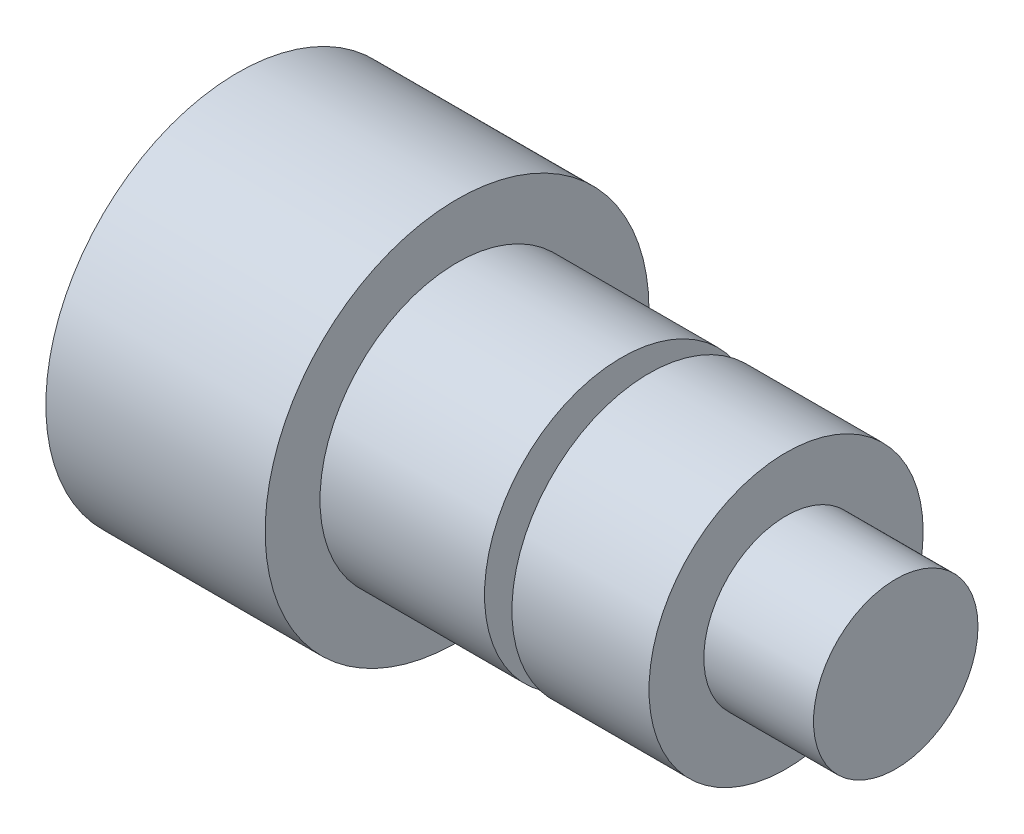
ISO-10303-21;
HEADER;
FILE_DESCRIPTION(('STEP AP214'),'2;1');
FILE_NAME('part.step','',(''),(''),'','','');
FILE_SCHEMA(('AUTOMOTIVE_DESIGN { 1 0 10303 214 1 1 1 1 }'));
ENDSEC;
DATA;
#1=APPLICATION_CONTEXT('core data for automotive mechanical design processes');
#2=APPLICATION_PROTOCOL_DEFINITION('international standard','automotive_design',2000,#1);
#3=PRODUCT_CONTEXT('',#1,'mechanical');
#4=PRODUCT('Part','Part','',(#3));
#5=PRODUCT_RELATED_PRODUCT_CATEGORY('part','',(#4));
#6=PRODUCT_DEFINITION_FORMATION('','',#4);
#7=PRODUCT_DEFINITION_CONTEXT('part definition',#1,'design');
#8=PRODUCT_DEFINITION('design','',#6,#7);
#9=PRODUCT_DEFINITION_SHAPE('','',#8);
#10=(LENGTH_UNIT() NAMED_UNIT(*) SI_UNIT(.MILLI.,.METRE.));
#11=(NAMED_UNIT(*) PLANE_ANGLE_UNIT() SI_UNIT($,.RADIAN.));
#12=(NAMED_UNIT(*) SI_UNIT($,.STERADIAN.) SOLID_ANGLE_UNIT());
#13=UNCERTAINTY_MEASURE_WITH_UNIT(LENGTH_MEASURE(1.E-05),#10,'distance_accuracy_value','');
#14=(GEOMETRIC_REPRESENTATION_CONTEXT(3) GLOBAL_UNCERTAINTY_ASSIGNED_CONTEXT((#13)) GLOBAL_UNIT_ASSIGNED_CONTEXT((#10,
#11,#12)) REPRESENTATION_CONTEXT('',''));
#15=CARTESIAN_POINT('',(0.,0.,0.));
#16=DIRECTION('',(0.,0.,1.));
#17=DIRECTION('',(1.,0.,0.));
#18=AXIS2_PLACEMENT_3D('',#15,#16,#17);
#19=CARTESIAN_POINT('',(0.,0.,0.));
#20=DIRECTION('',(1.,0.,0.));
#21=DIRECTION('',(0.,0.,-1.));
#22=AXIS2_PLACEMENT_3D('',#19,#20,#21);
#23=PLANE('',#22);
#24=CARTESIAN_POINT('',(0.,0.,0.));
#25=DIRECTION('',(1.,0.,0.));
#26=DIRECTION('',(0.,0.,-1.));
#27=AXIS2_PLACEMENT_3D('',#24,#25,#26);
#28=CIRCLE('',#27,44.45);
#29=CARTESIAN_POINT('',(0.,0.,-44.45));
#30=VERTEX_POINT('',#29);
#31=EDGE_CURVE('E10',#30,#30,#28,.T.);
#32=ORIENTED_EDGE('',*,*,#31,.F.);
#33=EDGE_LOOP('',(#32));
#34=FACE_BOUND('',#33,.T.);
#35=ADVANCED_FACE('F30',(#34),#23,.F.);
#36=CARTESIAN_POINT('',(213.782929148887,0.,0.));
#37=DIRECTION('',(1.,0.,0.));
#38=DIRECTION('',(0.,0.,-1.));
#39=AXIS2_PLACEMENT_3D('',#36,#37,#38);
#40=CYLINDRICAL_SURFACE('',#39,44.45);
#41=CARTESIAN_POINT('',(50.8,0.,0.));
#42=DIRECTION('',(1.,0.,0.));
#43=DIRECTION('',(0.,0.,-1.));
#44=AXIS2_PLACEMENT_3D('',#41,#42,#43);
#45=CIRCLE('',#44,44.45);
#46=CARTESIAN_POINT('',(50.8,0.,-44.45));
#47=VERTEX_POINT('',#46);
#48=EDGE_CURVE('E36',#47,#47,#45,.T.);
#49=ORIENTED_EDGE('',*,*,#48,.F.);
#50=EDGE_LOOP('',(#49));
#51=FACE_BOUND('',#50,.T.);
#52=ORIENTED_EDGE('',*,*,#31,.T.);
#53=EDGE_LOOP('',(#52));
#54=FACE_BOUND('',#53,.T.);
#55=ADVANCED_FACE('F114',(#51,#54),#40,.T.);
#56=CARTESIAN_POINT('',(50.8,44.45,0.));
#57=DIRECTION('',(-1.,0.,0.));
#58=DIRECTION('',(0.,0.,1.));
#59=AXIS2_PLACEMENT_3D('',#56,#57,#58);
#60=PLANE('',#59);
#61=CARTESIAN_POINT('',(50.8,0.,0.));
#62=DIRECTION('',(1.,0.,0.));
#63=DIRECTION('',(0.,0.,-1.));
#64=AXIS2_PLACEMENT_3D('',#61,#62,#63);
#65=CIRCLE('',#64,31.75);
#66=CARTESIAN_POINT('',(50.8,0.,-31.75));
#67=VERTEX_POINT('',#66);
#68=EDGE_CURVE('E40',#67,#67,#65,.T.);
#69=ORIENTED_EDGE('',*,*,#68,.F.);
#70=EDGE_LOOP('',(#69));
#71=FACE_BOUND('',#70,.T.);
#72=ORIENTED_EDGE('',*,*,#48,.T.);
#73=EDGE_LOOP('',(#72));
#74=FACE_BOUND('',#73,.T.);
#75=ADVANCED_FACE('F109',(#71,#74),#60,.F.);
#76=CARTESIAN_POINT('',(213.782929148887,0.,0.));
#77=DIRECTION('',(1.,0.,0.));
#78=DIRECTION('',(0.,0.,-1.));
#79=AXIS2_PLACEMENT_3D('',#76,#77,#78);
#80=CYLINDRICAL_SURFACE('',#79,31.75);
#81=CARTESIAN_POINT('',(88.9,0.,0.));
#82=DIRECTION('',(1.,0.,0.));
#83=DIRECTION('',(0.,0.,-1.));
#84=AXIS2_PLACEMENT_3D('',#81,#82,#83);
#85=CIRCLE('',#84,31.75);
#86=CARTESIAN_POINT('',(88.9,0.,-31.75));
#87=VERTEX_POINT('',#86);
#88=EDGE_CURVE('E44',#87,#87,#85,.T.);
#89=ORIENTED_EDGE('',*,*,#88,.F.);
#90=EDGE_LOOP('',(#89));
#91=FACE_BOUND('',#90,.T.);
#92=ORIENTED_EDGE('',*,*,#68,.T.);
#93=EDGE_LOOP('',(#92));
#94=FACE_BOUND('',#93,.T.);
#95=ADVANCED_FACE('F103',(#91,#94),#80,.T.);
#96=CARTESIAN_POINT('',(88.9,31.75,0.));
#97=DIRECTION('',(-1.,0.,0.));
#98=DIRECTION('',(0.,0.,1.));
#99=AXIS2_PLACEMENT_3D('',#96,#97,#98);
#100=PLANE('',#99);
#101=CARTESIAN_POINT('',(88.9,0.,0.));
#102=DIRECTION('',(1.,0.,0.));
#103=DIRECTION('',(0.,0.,-1.));
#104=AXIS2_PLACEMENT_3D('',#101,#102,#103);
#105=CIRCLE('',#104,22.225);
#106=CARTESIAN_POINT('',(88.9,0.,-22.225));
#107=VERTEX_POINT('',#106);
#108=EDGE_CURVE('E49',#107,#107,#105,.T.);
#109=ORIENTED_EDGE('',*,*,#108,.F.);
#110=EDGE_LOOP('',(#109));
#111=FACE_BOUND('',#110,.T.);
#112=ORIENTED_EDGE('',*,*,#88,.T.);
#113=EDGE_LOOP('',(#112));
#114=FACE_BOUND('',#113,.T.);
#115=ADVANCED_FACE('F97',(#111,#114),#100,.F.);
#116=CARTESIAN_POINT('',(213.782929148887,0.,0.));
#117=DIRECTION('',(1.,0.,0.));
#118=DIRECTION('',(0.,0.,-1.));
#119=AXIS2_PLACEMENT_3D('',#116,#117,#118);
#120=CYLINDRICAL_SURFACE('',#119,22.225);
#121=CARTESIAN_POINT('',(95.25,0.,0.));
#122=DIRECTION('',(1.,0.,0.));
#123=DIRECTION('',(0.,0.,-1.));
#124=AXIS2_PLACEMENT_3D('',#121,#122,#123);
#125=CIRCLE('',#124,22.225);
#126=CARTESIAN_POINT('',(95.25,0.,-22.225));
#127=VERTEX_POINT('',#126);
#128=EDGE_CURVE('E52',#127,#127,#125,.T.);
#129=ORIENTED_EDGE('',*,*,#128,.F.);
#130=EDGE_LOOP('',(#129));
#131=FACE_BOUND('',#130,.T.);
#132=ORIENTED_EDGE('',*,*,#108,.T.);
#133=EDGE_LOOP('',(#132));
#134=FACE_BOUND('',#133,.T.);
#135=ADVANCED_FACE('F91',(#131,#134),#120,.T.);
#136=CARTESIAN_POINT('',(95.25,22.225,0.));
#137=DIRECTION('',(1.,0.,0.));
#138=DIRECTION('',(0.,0.,-1.));
#139=AXIS2_PLACEMENT_3D('',#136,#137,#138);
#140=PLANE('',#139);
#141=CARTESIAN_POINT('',(95.25,0.,0.));
#142=DIRECTION('',(1.,0.,0.));
#143=DIRECTION('',(0.,0.,-1.));
#144=AXIS2_PLACEMENT_3D('',#141,#142,#143);
#145=CIRCLE('',#144,31.75);
#146=CARTESIAN_POINT('',(95.25,0.,-31.75));
#147=VERTEX_POINT('',#146);
#148=EDGE_CURVE('E55',#147,#147,#145,.T.);
#149=ORIENTED_EDGE('',*,*,#148,.F.);
#150=EDGE_LOOP('',(#149));
#151=FACE_BOUND('',#150,.T.);
#152=ORIENTED_EDGE('',*,*,#128,.T.);
#153=EDGE_LOOP('',(#152));
#154=FACE_BOUND('',#153,.T.);
#155=ADVANCED_FACE('F85',(#151,#154),#140,.F.);
#156=CARTESIAN_POINT('',(213.782929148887,0.,0.));
#157=DIRECTION('',(1.,0.,0.));
#158=DIRECTION('',(0.,0.,-1.));
#159=AXIS2_PLACEMENT_3D('',#156,#157,#158);
#160=CYLINDRICAL_SURFACE('',#159,31.75);
#161=CARTESIAN_POINT('',(127.,0.,0.));
#162=DIRECTION('',(1.,0.,0.));
#163=DIRECTION('',(0.,0.,-1.));
#164=AXIS2_PLACEMENT_3D('',#161,#162,#163);
#165=CIRCLE('',#164,31.75);
#166=CARTESIAN_POINT('',(127.,0.,-31.75));
#167=VERTEX_POINT('',#166);
#168=EDGE_CURVE('E58',#167,#167,#165,.T.);
#169=ORIENTED_EDGE('',*,*,#168,.F.);
#170=EDGE_LOOP('',(#169));
#171=FACE_BOUND('',#170,.T.);
#172=ORIENTED_EDGE('',*,*,#148,.T.);
#173=EDGE_LOOP('',(#172));
#174=FACE_BOUND('',#173,.T.);
#175=ADVANCED_FACE('F79',(#171,#174),#160,.T.);
#176=CARTESIAN_POINT('',(127.,31.75,0.));
#177=DIRECTION('',(-1.,0.,0.));
#178=DIRECTION('',(0.,0.,1.));
#179=AXIS2_PLACEMENT_3D('',#176,#177,#178);
#180=PLANE('',#179);
#181=CARTESIAN_POINT('',(127.,0.,0.));
#182=DIRECTION('',(1.,0.,0.));
#183=DIRECTION('',(0.,0.,-1.));
#184=AXIS2_PLACEMENT_3D('',#181,#182,#183);
#185=CIRCLE('',#184,19.05);
#186=CARTESIAN_POINT('',(127.,0.,-19.05));
#187=VERTEX_POINT('',#186);
#188=EDGE_CURVE('E61',#187,#187,#185,.T.);
#189=ORIENTED_EDGE('',*,*,#188,.F.);
#190=EDGE_LOOP('',(#189));
#191=FACE_BOUND('',#190,.T.);
#192=ORIENTED_EDGE('',*,*,#168,.T.);
#193=EDGE_LOOP('',(#192));
#194=FACE_BOUND('',#193,.T.);
#195=ADVANCED_FACE('F73',(#191,#194),#180,.F.);
#196=CARTESIAN_POINT('',(213.782929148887,0.,0.));
#197=DIRECTION('',(1.,0.,0.));
#198=DIRECTION('',(0.,0.,-1.));
#199=AXIS2_PLACEMENT_3D('',#196,#197,#198);
#200=CYLINDRICAL_SURFACE('',#199,19.05);
#201=CARTESIAN_POINT('',(152.4,0.,0.));
#202=DIRECTION('',(1.,0.,0.));
#203=DIRECTION('',(0.,0.,-1.));
#204=AXIS2_PLACEMENT_3D('',#201,#202,#203);
#205=CIRCLE('',#204,19.05);
#206=CARTESIAN_POINT('',(152.4,0.,-19.05));
#207=VERTEX_POINT('',#206);
#208=EDGE_CURVE('E64',#207,#207,#205,.T.);
#209=ORIENTED_EDGE('',*,*,#208,.F.);
#210=EDGE_LOOP('',(#209));
#211=FACE_BOUND('',#210,.T.);
#212=ORIENTED_EDGE('',*,*,#188,.T.);
#213=EDGE_LOOP('',(#212));
#214=FACE_BOUND('',#213,.T.);
#215=ADVANCED_FACE('F70',(#211,#214),#200,.T.);
#216=CARTESIAN_POINT('',(152.4,19.05,0.));
#217=DIRECTION('',(-1.,0.,0.));
#218=DIRECTION('',(0.,0.,1.));
#219=AXIS2_PLACEMENT_3D('',#216,#217,#218);
#220=PLANE('',#219);
#221=ORIENTED_EDGE('',*,*,#208,.T.);
#222=EDGE_LOOP('',(#221));
#223=FACE_BOUND('',#222,.T.);
#224=ADVANCED_FACE('F68',(#223),#220,.F.);
#225=CLOSED_SHELL('',(#35,#55,#75,#95,#115,#135,#155,#175,#195,#215,#224));
#226=MANIFOLD_SOLID_BREP('B2',#225);
#227=ADVANCED_BREP_SHAPE_REPRESENTATION('',(#18,#226),#14);
#228=SHAPE_DEFINITION_REPRESENTATION(#9,#227);
ENDSEC;
END-ISO-10303-21;
